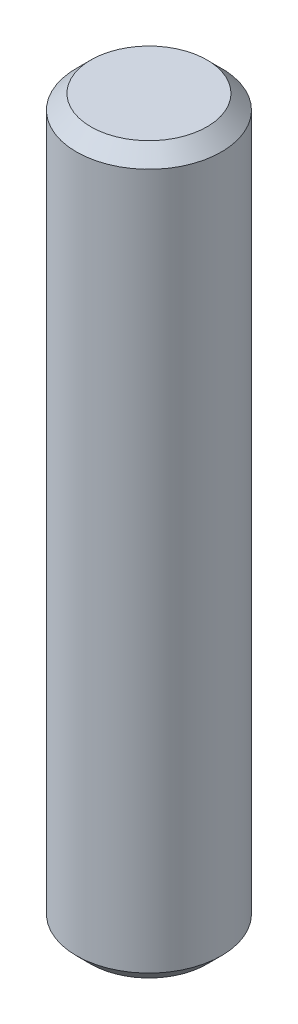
from build123d import *

# Parameters (mm, degrees)
SKETCH1_R           = 0.5
BOSS_EXTRUDE1_DEPTH = 5
CHAMFER1_SIZE       = 0.1


with BuildPart() as part:
    # Sketch1 → Boss-Extrude1 (new body)
    with BuildSketch(Plane(origin=(0, 0, 0), x_dir=(1, 0, 0), z_dir=(0, 1, 0))):
        with Locations(Location((0, 0, 0), (0, 0, 270))):
            Circle(SKETCH1_R)
    extrude(amount=BOSS_EXTRUDE1_DEPTH)

    # Chamfer1
    chamfer1_edges = [part.edges().sort_by_distance(p)[0] for p in [
        (0, 0, -0.5),
        (0, 5, -0.5),
    ]]
    chamfer(chamfer1_edges, length=CHAMFER1_SIZE)


solid = part.part
